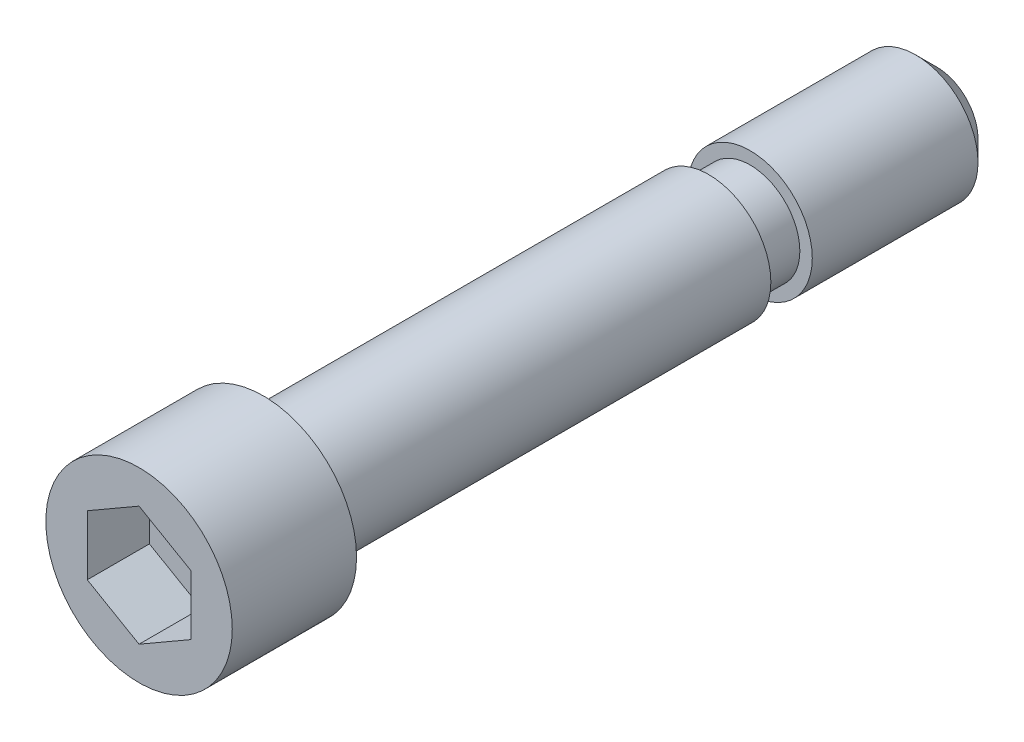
ISO-10303-21;
HEADER;
FILE_DESCRIPTION(('STEP AP214'),'2;1');
FILE_NAME('part.step','',(''),(''),'','','');
FILE_SCHEMA(('AUTOMOTIVE_DESIGN { 1 0 10303 214 1 1 1 1 }'));
ENDSEC;
DATA;
#1=APPLICATION_CONTEXT('core data for automotive mechanical design processes');
#2=APPLICATION_PROTOCOL_DEFINITION('international standard','automotive_design',2000,#1);
#3=PRODUCT_CONTEXT('',#1,'mechanical');
#4=PRODUCT('Part','Part','',(#3));
#5=PRODUCT_RELATED_PRODUCT_CATEGORY('part','',(#4));
#6=PRODUCT_DEFINITION_FORMATION('','',#4);
#7=PRODUCT_DEFINITION_CONTEXT('part definition',#1,'design');
#8=PRODUCT_DEFINITION('design','',#6,#7);
#9=PRODUCT_DEFINITION_SHAPE('','',#8);
#10=(LENGTH_UNIT() NAMED_UNIT(*) SI_UNIT(.MILLI.,.METRE.));
#11=(NAMED_UNIT(*) PLANE_ANGLE_UNIT() SI_UNIT($,.RADIAN.));
#12=(NAMED_UNIT(*) SI_UNIT($,.STERADIAN.) SOLID_ANGLE_UNIT());
#13=UNCERTAINTY_MEASURE_WITH_UNIT(LENGTH_MEASURE(1.E-05),#10,'distance_accuracy_value','');
#14=(GEOMETRIC_REPRESENTATION_CONTEXT(3) GLOBAL_UNCERTAINTY_ASSIGNED_CONTEXT((#13)) GLOBAL_UNIT_ASSIGNED_CONTEXT((#10,
#11,#12)) REPRESENTATION_CONTEXT('',''));
#15=CARTESIAN_POINT('',(0.,0.,0.));
#16=DIRECTION('',(0.,0.,1.));
#17=DIRECTION('',(1.,0.,0.));
#18=AXIS2_PLACEMENT_3D('',#15,#16,#17);
#19=CARTESIAN_POINT('',(0.,0.,-65.));
#20=DIRECTION('',(0.,0.,1.));
#21=DIRECTION('',(1.,0.,0.));
#22=AXIS2_PLACEMENT_3D('',#19,#20,#21);
#23=PLANE('',#22);
#24=CARTESIAN_POINT('',(0.,0.,-65.));
#25=DIRECTION('',(0.,0.,1.));
#26=DIRECTION('',(1.,0.,0.));
#27=AXIS2_PLACEMENT_3D('',#24,#25,#26);
#28=CIRCLE('',#27,4.);
#29=CARTESIAN_POINT('',(4.,0.,-65.));
#30=VERTEX_POINT('',#29);
#31=EDGE_CURVE('E9',#30,#30,#28,.T.);
#32=ORIENTED_EDGE('',*,*,#31,.F.);
#33=EDGE_LOOP('',(#32));
#34=FACE_BOUND('',#33,.T.);
#35=ADVANCED_FACE('F14',(#34),#23,.F.);
#36=CARTESIAN_POINT('',(0.,0.,-65.));
#37=DIRECTION('',(0.,0.,1.));
#38=DIRECTION('',(1.,0.,0.));
#39=AXIS2_PLACEMENT_3D('',#36,#37,#38);
#40=CONICAL_SURFACE('',#39,4.,0.785398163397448);
#41=CARTESIAN_POINT('',(0.,0.,-63.));
#42=DIRECTION('',(0.,0.,1.));
#43=DIRECTION('',(1.,0.,0.));
#44=AXIS2_PLACEMENT_3D('',#41,#42,#43);
#45=CIRCLE('',#44,6.);
#46=CARTESIAN_POINT('',(6.,0.,-63.));
#47=VERTEX_POINT('',#46);
#48=EDGE_CURVE('E21',#47,#47,#45,.T.);
#49=ORIENTED_EDGE('',*,*,#48,.F.);
#50=EDGE_LOOP('',(#49));
#51=FACE_BOUND('',#50,.T.);
#52=ORIENTED_EDGE('',*,*,#31,.T.);
#53=EDGE_LOOP('',(#52));
#54=FACE_BOUND('',#53,.T.);
#55=ADVANCED_FACE('F147',(#51,#54),#40,.T.);
#56=CARTESIAN_POINT('',(0.,0.,15.));
#57=DIRECTION('',(0.,0.,1.));
#58=DIRECTION('',(1.,0.,0.));
#59=AXIS2_PLACEMENT_3D('',#56,#57,#58);
#60=CYLINDRICAL_SURFACE('',#59,6.);
#61=CARTESIAN_POINT('',(0.,0.,-47.));
#62=DIRECTION('',(0.,0.,1.));
#63=DIRECTION('',(1.,0.,0.));
#64=AXIS2_PLACEMENT_3D('',#61,#62,#63);
#65=CIRCLE('',#64,6.);
#66=CARTESIAN_POINT('',(6.,0.,-47.));
#67=VERTEX_POINT('',#66);
#68=EDGE_CURVE('E140',#67,#67,#65,.T.);
#69=ORIENTED_EDGE('',*,*,#68,.F.);
#70=EDGE_LOOP('',(#69));
#71=FACE_BOUND('',#70,.T.);
#72=ORIENTED_EDGE('',*,*,#48,.T.);
#73=EDGE_LOOP('',(#72));
#74=FACE_BOUND('',#73,.T.);
#75=ADVANCED_FACE('F145',(#71,#74),#60,.T.);
#76=CARTESIAN_POINT('',(-6.,0.,-47.));
#77=DIRECTION('',(0.,0.,-1.));
#78=DIRECTION('',(-1.,0.,0.));
#79=AXIS2_PLACEMENT_3D('',#76,#77,#78);
#80=PLANE('',#79);
#81=CARTESIAN_POINT('',(0.,0.,-47.));
#82=DIRECTION('',(0.,0.,1.));
#83=DIRECTION('',(1.,0.,0.));
#84=AXIS2_PLACEMENT_3D('',#81,#82,#83);
#85=CIRCLE('',#84,4.8);
#86=CARTESIAN_POINT('',(4.8,0.,-47.));
#87=VERTEX_POINT('',#86);
#88=EDGE_CURVE('E137',#87,#87,#85,.T.);
#89=ORIENTED_EDGE('',*,*,#88,.F.);
#90=EDGE_LOOP('',(#89));
#91=FACE_BOUND('',#90,.T.);
#92=ORIENTED_EDGE('',*,*,#68,.T.);
#93=EDGE_LOOP('',(#92));
#94=FACE_BOUND('',#93,.T.);
#95=ADVANCED_FACE('F170',(#91,#94),#80,.F.);
#96=CARTESIAN_POINT('',(0.,0.,15.));
#97=DIRECTION('',(0.,0.,1.));
#98=DIRECTION('',(1.,0.,0.));
#99=AXIS2_PLACEMENT_3D('',#96,#97,#98);
#100=CYLINDRICAL_SURFACE('',#99,4.8);
#101=CARTESIAN_POINT('',(0.,0.,-43.));
#102=DIRECTION('',(0.,0.,1.));
#103=DIRECTION('',(1.,0.,0.));
#104=AXIS2_PLACEMENT_3D('',#101,#102,#103);
#105=CIRCLE('',#104,4.8);
#106=CARTESIAN_POINT('',(4.8,0.,-43.));
#107=VERTEX_POINT('',#106);
#108=EDGE_CURVE('E134',#107,#107,#105,.T.);
#109=ORIENTED_EDGE('',*,*,#108,.F.);
#110=EDGE_LOOP('',(#109));
#111=FACE_BOUND('',#110,.T.);
#112=ORIENTED_EDGE('',*,*,#88,.T.);
#113=EDGE_LOOP('',(#112));
#114=FACE_BOUND('',#113,.T.);
#115=ADVANCED_FACE('F179',(#111,#114),#100,.T.);
#116=CARTESIAN_POINT('',(-4.8,0.,-43.));
#117=DIRECTION('',(0.,0.,1.));
#118=DIRECTION('',(1.,0.,0.));
#119=AXIS2_PLACEMENT_3D('',#116,#117,#118);
#120=PLANE('',#119);
#121=CARTESIAN_POINT('',(0.,0.,-43.));
#122=DIRECTION('',(0.,0.,1.));
#123=DIRECTION('',(1.,0.,0.));
#124=AXIS2_PLACEMENT_3D('',#121,#122,#123);
#125=CIRCLE('',#124,6.);
#126=CARTESIAN_POINT('',(6.,0.,-43.));
#127=VERTEX_POINT('',#126);
#128=EDGE_CURVE('E131',#127,#127,#125,.T.);
#129=ORIENTED_EDGE('',*,*,#128,.F.);
#130=EDGE_LOOP('',(#129));
#131=FACE_BOUND('',#130,.T.);
#132=ORIENTED_EDGE('',*,*,#108,.T.);
#133=EDGE_LOOP('',(#132));
#134=FACE_BOUND('',#133,.T.);
#135=ADVANCED_FACE('F188',(#131,#134),#120,.F.);
#136=CARTESIAN_POINT('',(0.,0.,15.));
#137=DIRECTION('',(0.,0.,1.));
#138=DIRECTION('',(1.,0.,0.));
#139=AXIS2_PLACEMENT_3D('',#136,#137,#138);
#140=CYLINDRICAL_SURFACE('',#139,6.);
#141=CARTESIAN_POINT('',(0.,0.,0.));
#142=DIRECTION('',(0.,0.,1.));
#143=DIRECTION('',(1.,0.,0.));
#144=AXIS2_PLACEMENT_3D('',#141,#142,#143);
#145=CIRCLE('',#144,6.);
#146=CARTESIAN_POINT('',(6.,0.,0.));
#147=VERTEX_POINT('',#146);
#148=EDGE_CURVE('E128',#147,#147,#145,.T.);
#149=ORIENTED_EDGE('',*,*,#148,.F.);
#150=EDGE_LOOP('',(#149));
#151=FACE_BOUND('',#150,.T.);
#152=ORIENTED_EDGE('',*,*,#128,.T.);
#153=EDGE_LOOP('',(#152));
#154=FACE_BOUND('',#153,.T.);
#155=ADVANCED_FACE('F197',(#151,#154),#140,.T.);
#156=CARTESIAN_POINT('',(-6.,0.,0.));
#157=DIRECTION('',(0.,0.,1.));
#158=DIRECTION('',(1.,0.,0.));
#159=AXIS2_PLACEMENT_3D('',#156,#157,#158);
#160=PLANE('',#159);
#161=CARTESIAN_POINT('',(0.,0.,0.));
#162=DIRECTION('',(0.,0.,1.));
#163=DIRECTION('',(1.,0.,0.));
#164=AXIS2_PLACEMENT_3D('',#161,#162,#163);
#165=CIRCLE('',#164,9.);
#166=CARTESIAN_POINT('',(9.,0.,0.));
#167=VERTEX_POINT('',#166);
#168=EDGE_CURVE('E125',#167,#167,#165,.T.);
#169=ORIENTED_EDGE('',*,*,#168,.F.);
#170=EDGE_LOOP('',(#169));
#171=FACE_BOUND('',#170,.T.);
#172=ORIENTED_EDGE('',*,*,#148,.T.);
#173=EDGE_LOOP('',(#172));
#174=FACE_BOUND('',#173,.T.);
#175=ADVANCED_FACE('F206',(#171,#174),#160,.F.);
#176=CARTESIAN_POINT('',(0.,0.,15.));
#177=DIRECTION('',(0.,0.,1.));
#178=DIRECTION('',(1.,0.,0.));
#179=AXIS2_PLACEMENT_3D('',#176,#177,#178);
#180=CYLINDRICAL_SURFACE('',#179,9.);
#181=CARTESIAN_POINT('',(0.,0.,12.));
#182=DIRECTION('',(0.,0.,1.));
#183=DIRECTION('',(1.,0.,0.));
#184=AXIS2_PLACEMENT_3D('',#181,#182,#183);
#185=CIRCLE('',#184,9.);
#186=CARTESIAN_POINT('',(9.,0.,12.));
#187=VERTEX_POINT('',#186);
#188=EDGE_CURVE('E116',#187,#187,#185,.T.);
#189=ORIENTED_EDGE('',*,*,#188,.F.);
#190=EDGE_LOOP('',(#189));
#191=FACE_BOUND('',#190,.T.);
#192=ORIENTED_EDGE('',*,*,#168,.T.);
#193=EDGE_LOOP('',(#192));
#194=FACE_BOUND('',#193,.T.);
#195=ADVANCED_FACE('F215',(#191,#194),#180,.T.);
#196=CARTESIAN_POINT('',(-9.,0.,12.));
#197=DIRECTION('',(0.,0.,-1.));
#198=DIRECTION('',(-1.,0.,0.));
#199=AXIS2_PLACEMENT_3D('',#196,#197,#198);
#200=PLANE('',#199);
#201=DIRECTION('',(-0.866025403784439,-0.5,0.));
#202=VECTOR('',#201,1.);
#203=CARTESIAN_POINT('',(0.,5.77350269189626,12.));
#204=LINE('',#203,#202);
#205=CARTESIAN_POINT('',(0.,5.77350269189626,12.));
#206=VERTEX_POINT('',#205);
#207=CARTESIAN_POINT('',(-5.,2.88675134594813,12.));
#208=VERTEX_POINT('',#207);
#209=EDGE_CURVE('E82',#206,#208,#204,.T.);
#210=ORIENTED_EDGE('',*,*,#209,.F.);
#211=DIRECTION('',(-0.866025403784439,0.5,0.));
#212=VECTOR('',#211,1.);
#213=CARTESIAN_POINT('',(5.,2.88675134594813,12.));
#214=LINE('',#213,#212);
#215=CARTESIAN_POINT('',(5.,2.88675134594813,12.));
#216=VERTEX_POINT('',#215);
#217=EDGE_CURVE('E28',#216,#206,#214,.T.);
#218=ORIENTED_EDGE('',*,*,#217,.F.);
#219=DIRECTION('',(0.,1.,0.));
#220=VECTOR('',#219,1.);
#221=CARTESIAN_POINT('',(5.,-2.88675134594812,12.));
#222=LINE('',#221,#220);
#223=CARTESIAN_POINT('',(5.,-2.88675134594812,12.));
#224=VERTEX_POINT('',#223);
#225=EDGE_CURVE('E98',#224,#216,#222,.T.);
#226=ORIENTED_EDGE('',*,*,#225,.F.);
#227=DIRECTION('',(0.866025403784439,0.5,0.));
#228=VECTOR('',#227,1.);
#229=CARTESIAN_POINT('',(0.,-5.77350269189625,12.));
#230=LINE('',#229,#228);
#231=CARTESIAN_POINT('',(0.,-5.77350269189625,12.));
#232=VERTEX_POINT('',#231);
#233=EDGE_CURVE('E92',#232,#224,#230,.T.);
#234=ORIENTED_EDGE('',*,*,#233,.F.);
#235=DIRECTION('',(0.866025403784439,-0.5,0.));
#236=VECTOR('',#235,1.);
#237=CARTESIAN_POINT('',(-5.,-2.88675134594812,12.));
#238=LINE('',#237,#236);
#239=CARTESIAN_POINT('',(-5.,-2.88675134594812,12.));
#240=VERTEX_POINT('',#239);
#241=EDGE_CURVE('E90',#240,#232,#238,.T.);
#242=ORIENTED_EDGE('',*,*,#241,.F.);
#243=DIRECTION('',(0.,-1.,0.));
#244=VECTOR('',#243,1.);
#245=CARTESIAN_POINT('',(-5.,2.88675134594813,12.));
#246=LINE('',#245,#244);
#247=EDGE_CURVE('E71',#208,#240,#246,.T.);
#248=ORIENTED_EDGE('',*,*,#247,.F.);
#249=EDGE_LOOP('',(#210,#218,#226,#234,#242,#248));
#250=FACE_BOUND('',#249,.T.);
#251=ORIENTED_EDGE('',*,*,#188,.T.);
#252=EDGE_LOOP('',(#251));
#253=FACE_BOUND('',#252,.T.);
#254=ADVANCED_FACE('F86',(#250,#253),#200,.F.);
#255=CARTESIAN_POINT('',(5.,2.88675134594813,6.));
#256=DIRECTION('',(0.5,0.866025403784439,0.));
#257=DIRECTION('',(-0.866025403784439,0.5,0.));
#258=AXIS2_PLACEMENT_3D('',#255,#256,#257);
#259=PLANE('',#258);
#260=ORIENTED_EDGE('',*,*,#217,.T.);
#261=DIRECTION('',(0.,0.,1.));
#262=VECTOR('',#261,1.);
#263=CARTESIAN_POINT('',(0.,5.77350269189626,6.));
#264=LINE('',#263,#262);
#265=CARTESIAN_POINT('',(0.,5.77350269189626,6.));
#266=VERTEX_POINT('',#265);
#267=EDGE_CURVE('E79',#266,#206,#264,.T.);
#268=ORIENTED_EDGE('',*,*,#267,.F.);
#269=DIRECTION('',(-0.866025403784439,0.5,0.));
#270=VECTOR('',#269,1.);
#271=CARTESIAN_POINT('',(5.,2.88675134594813,6.));
#272=LINE('',#271,#270);
#273=CARTESIAN_POINT('',(5.,2.88675134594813,6.));
#274=VERTEX_POINT('',#273);
#275=EDGE_CURVE('E100',#274,#266,#272,.T.);
#276=ORIENTED_EDGE('',*,*,#275,.F.);
#277=DIRECTION('',(0.,0.,1.));
#278=VECTOR('',#277,1.);
#279=CARTESIAN_POINT('',(5.,2.88675134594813,6.));
#280=LINE('',#279,#278);
#281=EDGE_CURVE('E35',#274,#216,#280,.T.);
#282=ORIENTED_EDGE('',*,*,#281,.T.);
#283=EDGE_LOOP('',(#260,#268,#276,#282));
#284=FACE_BOUND('',#283,.T.);
#285=ADVANCED_FACE('F232',(#284),#259,.F.);
#286=CARTESIAN_POINT('',(5.,-2.88675134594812,6.));
#287=DIRECTION('',(1.,0.,0.));
#288=DIRECTION('',(0.,0.,-1.));
#289=AXIS2_PLACEMENT_3D('',#286,#287,#288);
#290=PLANE('',#289);
#291=ORIENTED_EDGE('',*,*,#225,.T.);
#292=ORIENTED_EDGE('',*,*,#281,.F.);
#293=DIRECTION('',(0.,1.,0.));
#294=VECTOR('',#293,1.);
#295=CARTESIAN_POINT('',(5.,-2.88675134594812,6.));
#296=LINE('',#295,#294);
#297=CARTESIAN_POINT('',(5.,-2.88675134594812,6.));
#298=VERTEX_POINT('',#297);
#299=EDGE_CURVE('E112',#298,#274,#296,.T.);
#300=ORIENTED_EDGE('',*,*,#299,.F.);
#301=DIRECTION('',(0.,0.,1.));
#302=VECTOR('',#301,1.);
#303=CARTESIAN_POINT('',(5.,-2.88675134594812,6.));
#304=LINE('',#303,#302);
#305=EDGE_CURVE('E117',#298,#224,#304,.T.);
#306=ORIENTED_EDGE('',*,*,#305,.T.);
#307=EDGE_LOOP('',(#291,#292,#300,#306));
#308=FACE_BOUND('',#307,.T.);
#309=ADVANCED_FACE('F240',(#308),#290,.F.);
#310=CARTESIAN_POINT('',(0.,-5.77350269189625,6.));
#311=DIRECTION('',(0.5,-0.866025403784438,0.));
#312=DIRECTION('',(0.866025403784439,0.5,0.));
#313=AXIS2_PLACEMENT_3D('',#310,#311,#312);
#314=PLANE('',#313);
#315=ORIENTED_EDGE('',*,*,#233,.T.);
#316=ORIENTED_EDGE('',*,*,#305,.F.);
#317=DIRECTION('',(0.866025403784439,0.5,0.));
#318=VECTOR('',#317,1.);
#319=CARTESIAN_POINT('',(0.,-5.77350269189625,6.));
#320=LINE('',#319,#318);
#321=CARTESIAN_POINT('',(0.,-5.77350269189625,6.));
#322=VERTEX_POINT('',#321);
#323=EDGE_CURVE('E109',#322,#298,#320,.T.);
#324=ORIENTED_EDGE('',*,*,#323,.F.);
#325=DIRECTION('',(0.,0.,1.));
#326=VECTOR('',#325,1.);
#327=CARTESIAN_POINT('',(0.,-5.77350269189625,6.));
#328=LINE('',#327,#326);
#329=EDGE_CURVE('E119',#322,#232,#328,.T.);
#330=ORIENTED_EDGE('',*,*,#329,.T.);
#331=EDGE_LOOP('',(#315,#316,#324,#330));
#332=FACE_BOUND('',#331,.T.);
#333=ADVANCED_FACE('F248',(#332),#314,.F.);
#334=CARTESIAN_POINT('',(-5.,-2.88675134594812,6.));
#335=DIRECTION('',(-0.5,-0.866025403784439,0.));
#336=DIRECTION('',(0.866025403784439,-0.5,0.));
#337=AXIS2_PLACEMENT_3D('',#334,#335,#336);
#338=PLANE('',#337);
#339=ORIENTED_EDGE('',*,*,#241,.T.);
#340=ORIENTED_EDGE('',*,*,#329,.F.);
#341=DIRECTION('',(0.866025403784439,-0.5,0.));
#342=VECTOR('',#341,1.);
#343=CARTESIAN_POINT('',(-5.,-2.88675134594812,6.));
#344=LINE('',#343,#342);
#345=CARTESIAN_POINT('',(-5.,-2.88675134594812,6.));
#346=VERTEX_POINT('',#345);
#347=EDGE_CURVE('E106',#346,#322,#344,.T.);
#348=ORIENTED_EDGE('',*,*,#347,.F.);
#349=DIRECTION('',(0.,0.,1.));
#350=VECTOR('',#349,1.);
#351=CARTESIAN_POINT('',(-5.,-2.88675134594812,6.));
#352=LINE('',#351,#350);
#353=EDGE_CURVE('E78',#346,#240,#352,.T.);
#354=ORIENTED_EDGE('',*,*,#353,.T.);
#355=EDGE_LOOP('',(#339,#340,#348,#354));
#356=FACE_BOUND('',#355,.T.);
#357=ADVANCED_FACE('F256',(#356),#338,.F.);
#358=CARTESIAN_POINT('',(-5.,2.88675134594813,6.));
#359=DIRECTION('',(-1.,0.,0.));
#360=DIRECTION('',(0.,0.,1.));
#361=AXIS2_PLACEMENT_3D('',#358,#359,#360);
#362=PLANE('',#361);
#363=ORIENTED_EDGE('',*,*,#247,.T.);
#364=ORIENTED_EDGE('',*,*,#353,.F.);
#365=DIRECTION('',(0.,-1.,0.));
#366=VECTOR('',#365,1.);
#367=CARTESIAN_POINT('',(-5.,2.88675134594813,6.));
#368=LINE('',#367,#366);
#369=CARTESIAN_POINT('',(-5.,2.88675134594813,6.));
#370=VERTEX_POINT('',#369);
#371=EDGE_CURVE('E74',#370,#346,#368,.T.);
#372=ORIENTED_EDGE('',*,*,#371,.F.);
#373=DIRECTION('',(0.,0.,1.));
#374=VECTOR('',#373,1.);
#375=CARTESIAN_POINT('',(-5.,2.88675134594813,6.));
#376=LINE('',#375,#374);
#377=EDGE_CURVE('E67',#370,#208,#376,.T.);
#378=ORIENTED_EDGE('',*,*,#377,.T.);
#379=EDGE_LOOP('',(#363,#364,#372,#378));
#380=FACE_BOUND('',#379,.T.);
#381=ADVANCED_FACE('F69',(#380),#362,.F.);
#382=CARTESIAN_POINT('',(0.,5.77350269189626,6.));
#383=DIRECTION('',(-0.5,0.866025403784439,0.));
#384=DIRECTION('',(-0.866025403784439,-0.5,0.));
#385=AXIS2_PLACEMENT_3D('',#382,#383,#384);
#386=PLANE('',#385);
#387=ORIENTED_EDGE('',*,*,#209,.T.);
#388=ORIENTED_EDGE('',*,*,#377,.F.);
#389=DIRECTION('',(-0.866025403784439,-0.5,0.));
#390=VECTOR('',#389,1.);
#391=CARTESIAN_POINT('',(0.,5.77350269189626,6.));
#392=LINE('',#391,#390);
#393=EDGE_CURVE('E103',#266,#370,#392,.T.);
#394=ORIENTED_EDGE('',*,*,#393,.F.);
#395=ORIENTED_EDGE('',*,*,#267,.T.);
#396=EDGE_LOOP('',(#387,#388,#394,#395));
#397=FACE_BOUND('',#396,.T.);
#398=ADVANCED_FACE('F83',(#397),#386,.F.);
#399=CARTESIAN_POINT('',(5.,2.88675134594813,6.));
#400=DIRECTION('',(0.,0.,-1.));
#401=DIRECTION('',(-1.,0.,0.));
#402=AXIS2_PLACEMENT_3D('',#399,#400,#401);
#403=PLANE('',#402);
#404=ORIENTED_EDGE('',*,*,#275,.T.);
#405=ORIENTED_EDGE('',*,*,#393,.T.);
#406=ORIENTED_EDGE('',*,*,#371,.T.);
#407=ORIENTED_EDGE('',*,*,#347,.T.);
#408=ORIENTED_EDGE('',*,*,#323,.T.);
#409=ORIENTED_EDGE('',*,*,#299,.T.);
#410=EDGE_LOOP('',(#404,#405,#406,#407,#408,#409));
#411=FACE_BOUND('',#410,.T.);
#412=ADVANCED_FACE('F280',(#411),#403,.F.);
#413=CLOSED_SHELL('',(#35,#55,#75,#95,#115,#135,#155,#175,#195,#254,#285,#309,#333,#357,#381,
#398,#412));
#414=MANIFOLD_SOLID_BREP('B1',#413);
#415=ADVANCED_BREP_SHAPE_REPRESENTATION('',(#18,#414),#14);
#416=SHAPE_DEFINITION_REPRESENTATION(#9,#415);
ENDSEC;
END-ISO-10303-21;
